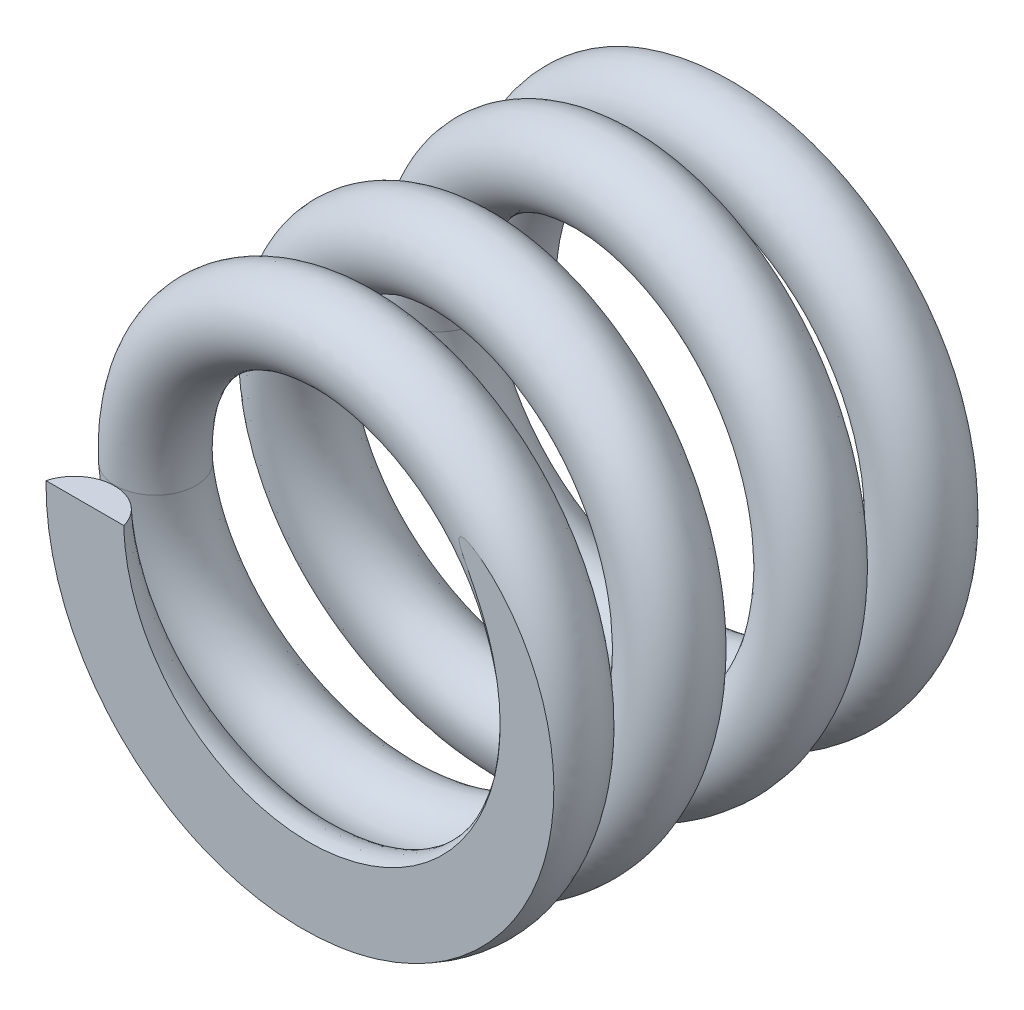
from build123d import *

# Parameters (mm, degrees)
SWEEP1_PITCH            = 5.08
SWEEP1_HEIGHT           = 10.16
SWEEP1_RADIUS           = 9.378191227
SWEEP1_START_ANGLE      = -180
SKETCH3_R               = 1.449923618
SWEEP2_PITCH            = 2.921
SWEEP2_HEIGHT           = 2.921
SWEEP2_RADIUS           = 7.905108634
SKETCH6_R               = 1.449923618
CUT_EXTRUDE3_DEPTH      = 18.631806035
CUT_EXTRUDE3_DEPTH_BACK = 18.631806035
SKETCH8_W               = 21.745549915
SKETCH8_H               = 4.515069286
SWEEP3_PITCH            = 2.921
SWEEP3_HEIGHT           = 2.921
SWEEP3_RADIUS           = 8.104974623
SWEEP3_START_ANGLE      = -180
SKETCH11_R              = 1.449923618
CUT_EXTRUDE4_DEPTH      = 20.678363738
CUT_EXTRUDE4_DEPTH_BACK = 20.678363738
SKETCH4_W               = 27.747001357
SKETCH4_H               = 8.215531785


with BuildPart() as part:
    # Sweep1: sweep along a helix
    with BuildLine() as sweep1_path:
        add(Helix(SWEEP1_PITCH, SWEEP1_HEIGHT, SWEEP1_RADIUS, center=(0, 0, 0), direction=(0, 0, 1), lefthand=True, mode=Mode.PRIVATE).rotate(Axis((0, 0, 0), (0, 0, 1)), SWEEP1_START_ANGLE))
    # Sketch3 → Sweep1 (sweep)
    with BuildSketch(Plane(origin=(0, 0, 0), x_dir=(1, 0, 0), z_dir=(0, 1, 0))):
        with Locations((-7.933313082, 0)):
            Circle(SKETCH3_R)
    sweep(path=sweep1_path.line, is_frenet=True)

    # Sweep2: sweep along a helix
    with BuildLine() as sweep2_path:
        Helix(SWEEP2_PITCH, SWEEP2_HEIGHT, SWEEP2_RADIUS, center=(0, 0, 0), direction=(0, 0, -1), lefthand=True)
    # Sketch6 → Sweep2 (sweep)
    with BuildSketch(Plane.XZ):
        with Locations((-7.933313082, 0)):
            Circle(SKETCH6_R)
    sweep(path=sweep2_path.line, is_frenet=True)

    # Sketch8 → Cut-Extrude3 (cut, two sides: drawn at the far end of the back side and taken through both)
    with BuildSketch(Plane(origin=(0, 0, 0), x_dir=(1, 0, 0), z_dir=(0, 1, 0)).offset(-CUT_EXTRUDE3_DEPTH_BACK)):
        with Locations((-0.158637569, 5.051534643)):
            Rectangle(SKETCH8_W, SKETCH8_H)
    extrude(amount=CUT_EXTRUDE3_DEPTH + CUT_EXTRUDE3_DEPTH_BACK, mode=Mode.SUBTRACT)

    # Sweep3: sweep along a helix
    with BuildLine() as sweep3_path:
        add(Helix(SWEEP3_PITCH, SWEEP3_HEIGHT, SWEEP3_RADIUS, center=(0, 0, 12.7), direction=(0, 0, 1), lefthand=True, mode=Mode.PRIVATE).rotate(Axis((0, 0, 12.7), (0, 0, 1)), SWEEP3_START_ANGLE))
    # Sketch11 → Sweep3 (sweep)
    with BuildSketch(Plane(origin=(0, 0, 0), x_dir=(1, 0, 0), z_dir=(0, 1, 0))):
        with Locations((-7.933313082, -10.16)):
            Circle(SKETCH11_R)
    sweep(path=sweep3_path.line, is_frenet=True)

    # Sketch4 → Cut-Extrude4 (cut, two sides: drawn at the far end of the back side and taken through both)
    with BuildSketch(Plane(origin=(0, 0, 0), x_dir=(1, 0, 0), z_dir=(0, 1, 0)).offset(-CUT_EXTRUDE4_DEPTH_BACK)):
        with Locations((-0.055817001, -16.807765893)):
            Rectangle(SKETCH4_W, SKETCH4_H)
    extrude(amount=CUT_EXTRUDE4_DEPTH + CUT_EXTRUDE4_DEPTH_BACK, mode=Mode.SUBTRACT)


solid = part.part
